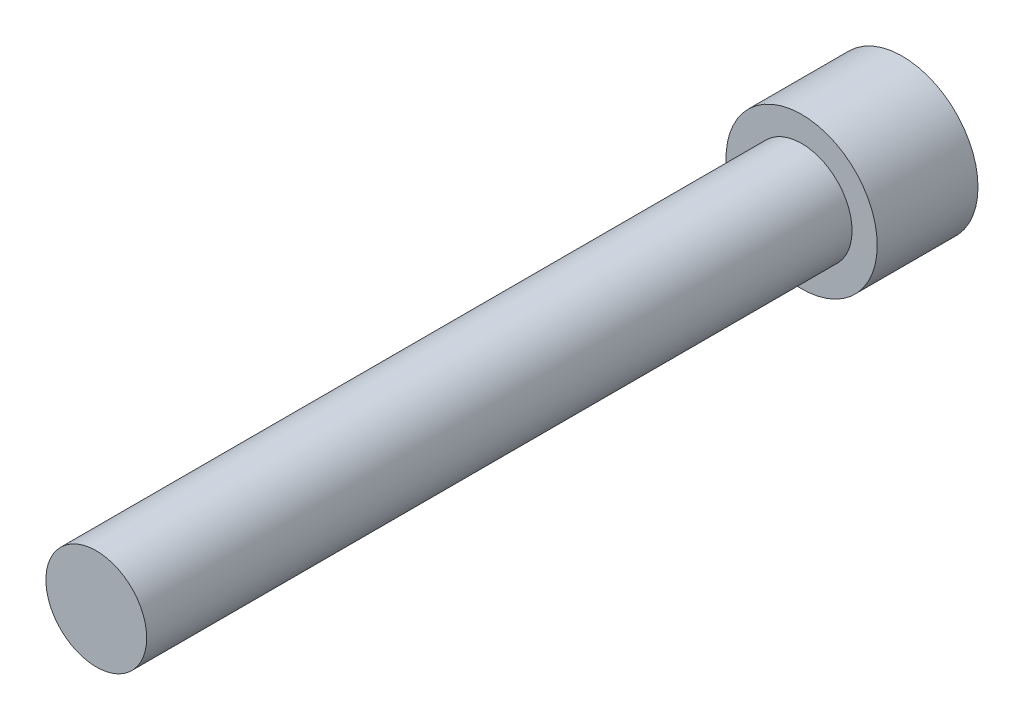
ISO-10303-21;
HEADER;
FILE_DESCRIPTION(('STEP AP214'),'2;1');
FILE_NAME('part.step','',(''),(''),'','','');
FILE_SCHEMA(('AUTOMOTIVE_DESIGN { 1 0 10303 214 1 1 1 1 }'));
ENDSEC;
DATA;
#1=APPLICATION_CONTEXT('core data for automotive mechanical design processes');
#2=APPLICATION_PROTOCOL_DEFINITION('international standard','automotive_design',2000,#1);
#3=PRODUCT_CONTEXT('',#1,'mechanical');
#4=PRODUCT('Part','Part','',(#3));
#5=PRODUCT_RELATED_PRODUCT_CATEGORY('part','',(#4));
#6=PRODUCT_DEFINITION_FORMATION('','',#4);
#7=PRODUCT_DEFINITION_CONTEXT('part definition',#1,'design');
#8=PRODUCT_DEFINITION('design','',#6,#7);
#9=PRODUCT_DEFINITION_SHAPE('','',#8);
#10=(LENGTH_UNIT() NAMED_UNIT(*) SI_UNIT(.MILLI.,.METRE.));
#11=(NAMED_UNIT(*) PLANE_ANGLE_UNIT() SI_UNIT($,.RADIAN.));
#12=(NAMED_UNIT(*) SI_UNIT($,.STERADIAN.) SOLID_ANGLE_UNIT());
#13=UNCERTAINTY_MEASURE_WITH_UNIT(LENGTH_MEASURE(1.E-05),#10,'distance_accuracy_value','');
#14=(GEOMETRIC_REPRESENTATION_CONTEXT(3) GLOBAL_UNCERTAINTY_ASSIGNED_CONTEXT((#13)) GLOBAL_UNIT_ASSIGNED_CONTEXT((#10,
#11,#12)) REPRESENTATION_CONTEXT('',''));
#15=CARTESIAN_POINT('',(0.,0.,0.));
#16=DIRECTION('',(0.,0.,1.));
#17=DIRECTION('',(1.,0.,0.));
#18=AXIS2_PLACEMENT_3D('',#15,#16,#17);
#19=CARTESIAN_POINT('',(0.,-4.7625,-6.35));
#20=DIRECTION('',(0.,0.,-1.));
#21=DIRECTION('',(-1.,0.,0.));
#22=AXIS2_PLACEMENT_3D('',#19,#20,#21);
#23=PLANE('',#22);
#24=DIRECTION('',(0.866025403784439,-0.5,0.));
#25=VECTOR('',#24,1.);
#26=CARTESIAN_POINT('',(0.,2.7569630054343,-6.35));
#27=LINE('',#26,#25);
#28=CARTESIAN_POINT('',(0.,2.7569630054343,-6.35));
#29=VERTEX_POINT('',#28);
#30=CARTESIAN_POINT('',(2.3876,1.37848150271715,-6.35));
#31=VERTEX_POINT('',#30);
#32=EDGE_CURVE('E46',#29,#31,#27,.T.);
#33=ORIENTED_EDGE('',*,*,#32,.F.);
#34=DIRECTION('',(0.866025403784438,0.5,0.));
#35=VECTOR('',#34,1.);
#36=CARTESIAN_POINT('',(-2.3876,1.37848150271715,-6.35));
#37=LINE('',#36,#35);
#38=CARTESIAN_POINT('',(-2.3876,1.37848150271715,-6.35));
#39=VERTEX_POINT('',#38);
#40=EDGE_CURVE('E129',#39,#29,#37,.T.);
#41=ORIENTED_EDGE('',*,*,#40,.F.);
#42=DIRECTION('',(0.,1.,0.));
#43=VECTOR('',#42,1.);
#44=CARTESIAN_POINT('',(-2.3876,-1.37848150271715,-6.35));
#45=LINE('',#44,#43);
#46=CARTESIAN_POINT('',(-2.3876,-1.37848150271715,-6.35));
#47=VERTEX_POINT('',#46);
#48=EDGE_CURVE('E127',#47,#39,#45,.T.);
#49=ORIENTED_EDGE('',*,*,#48,.F.);
#50=DIRECTION('',(-0.866025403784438,0.5,0.));
#51=VECTOR('',#50,1.);
#52=CARTESIAN_POINT('',(0.,-2.7569630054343,-6.35));
#53=LINE('',#52,#51);
#54=CARTESIAN_POINT('',(0.,-2.7569630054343,-6.35));
#55=VERTEX_POINT('',#54);
#56=EDGE_CURVE('E94',#55,#47,#53,.T.);
#57=ORIENTED_EDGE('',*,*,#56,.F.);
#58=DIRECTION('',(-0.866025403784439,-0.5,0.));
#59=VECTOR('',#58,1.);
#60=CARTESIAN_POINT('',(2.3876,-1.37848150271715,-6.35));
#61=LINE('',#60,#59);
#62=CARTESIAN_POINT('',(2.3876,-1.37848150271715,-6.35));
#63=VERTEX_POINT('',#62);
#64=EDGE_CURVE('E123',#63,#55,#61,.T.);
#65=ORIENTED_EDGE('',*,*,#64,.F.);
#66=DIRECTION('',(0.,-1.,0.));
#67=VECTOR('',#66,1.);
#68=CARTESIAN_POINT('',(2.3876,1.37848150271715,-6.35));
#69=LINE('',#68,#67);
#70=EDGE_CURVE('E120',#31,#63,#69,.T.);
#71=ORIENTED_EDGE('',*,*,#70,.F.);
#72=EDGE_LOOP('',(#33,#41,#49,#57,#65,#71));
#73=FACE_BOUND('',#72,.T.);
#74=CARTESIAN_POINT('',(0.,0.,-6.35));
#75=DIRECTION('',(0.,0.,1.));
#76=DIRECTION('',(1.,0.,0.));
#77=AXIS2_PLACEMENT_3D('',#74,#75,#76);
#78=CIRCLE('',#77,4.7625);
#79=CARTESIAN_POINT('',(4.7625,0.,-6.35));
#80=VERTEX_POINT('',#79);
#81=EDGE_CURVE('E11',#80,#80,#78,.T.);
#82=ORIENTED_EDGE('',*,*,#81,.F.);
#83=EDGE_LOOP('',(#82));
#84=FACE_BOUND('',#83,.T.);
#85=ADVANCED_FACE('F32',(#73,#84),#23,.T.);
#86=CARTESIAN_POINT('',(0.,0.,44.45));
#87=DIRECTION('',(0.,0.,1.));
#88=DIRECTION('',(1.,0.,0.));
#89=AXIS2_PLACEMENT_3D('',#86,#87,#88);
#90=CYLINDRICAL_SURFACE('',#89,4.7625);
#91=ORIENTED_EDGE('',*,*,#81,.T.);
#92=EDGE_LOOP('',(#91));
#93=FACE_BOUND('',#92,.T.);
#94=CARTESIAN_POINT('',(0.,0.,0.));
#95=DIRECTION('',(0.,0.,1.));
#96=DIRECTION('',(1.,0.,0.));
#97=AXIS2_PLACEMENT_3D('',#94,#95,#96);
#98=CIRCLE('',#97,4.7625);
#99=CARTESIAN_POINT('',(4.7625,0.,0.));
#100=VERTEX_POINT('',#99);
#101=EDGE_CURVE('E39',#100,#100,#98,.T.);
#102=ORIENTED_EDGE('',*,*,#101,.F.);
#103=EDGE_LOOP('',(#102));
#104=FACE_BOUND('',#103,.T.);
#105=ADVANCED_FACE('F149',(#93,#104),#90,.T.);
#106=CARTESIAN_POINT('',(0.,-3.175,0.));
#107=DIRECTION('',(0.,0.,1.));
#108=DIRECTION('',(1.,0.,0.));
#109=AXIS2_PLACEMENT_3D('',#106,#107,#108);
#110=PLANE('',#109);
#111=ORIENTED_EDGE('',*,*,#101,.T.);
#112=EDGE_LOOP('',(#111));
#113=FACE_BOUND('',#112,.T.);
#114=CARTESIAN_POINT('',(0.,0.,0.));
#115=DIRECTION('',(0.,0.,1.));
#116=DIRECTION('',(1.,0.,0.));
#117=AXIS2_PLACEMENT_3D('',#114,#115,#116);
#118=CIRCLE('',#117,3.175);
#119=CARTESIAN_POINT('',(3.175,0.,0.));
#120=VERTEX_POINT('',#119);
#121=EDGE_CURVE('E141',#120,#120,#118,.T.);
#122=ORIENTED_EDGE('',*,*,#121,.F.);
#123=EDGE_LOOP('',(#122));
#124=FACE_BOUND('',#123,.T.);
#125=ADVANCED_FACE('F146',(#113,#124),#110,.T.);
#126=CARTESIAN_POINT('',(0.,0.,44.45));
#127=DIRECTION('',(0.,0.,1.));
#128=DIRECTION('',(1.,0.,0.));
#129=AXIS2_PLACEMENT_3D('',#126,#127,#128);
#130=CYLINDRICAL_SURFACE('',#129,3.175);
#131=ORIENTED_EDGE('',*,*,#121,.T.);
#132=EDGE_LOOP('',(#131));
#133=FACE_BOUND('',#132,.T.);
#134=CARTESIAN_POINT('',(0.,0.,44.45));
#135=DIRECTION('',(0.,0.,1.));
#136=DIRECTION('',(1.,0.,0.));
#137=AXIS2_PLACEMENT_3D('',#134,#135,#136);
#138=CIRCLE('',#137,3.175);
#139=CARTESIAN_POINT('',(3.175,0.,44.45));
#140=VERTEX_POINT('',#139);
#141=EDGE_CURVE('E133',#140,#140,#138,.T.);
#142=ORIENTED_EDGE('',*,*,#141,.F.);
#143=EDGE_LOOP('',(#142));
#144=FACE_BOUND('',#143,.T.);
#145=ADVANCED_FACE('F156',(#133,#144),#130,.T.);
#146=CARTESIAN_POINT('',(0.,0.,44.45));
#147=DIRECTION('',(0.,0.,1.));
#148=DIRECTION('',(1.,0.,0.));
#149=AXIS2_PLACEMENT_3D('',#146,#147,#148);
#150=PLANE('',#149);
#151=ORIENTED_EDGE('',*,*,#141,.T.);
#152=EDGE_LOOP('',(#151));
#153=FACE_BOUND('',#152,.T.);
#154=ADVANCED_FACE('F162',(#153),#150,.T.);
#155=CARTESIAN_POINT('',(0.,2.7569630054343,-2.794));
#156=DIRECTION('',(0.5,0.866025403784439,0.));
#157=DIRECTION('',(-0.866025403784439,0.5,0.));
#158=AXIS2_PLACEMENT_3D('',#155,#156,#157);
#159=PLANE('',#158);
#160=ORIENTED_EDGE('',*,*,#32,.T.);
#161=DIRECTION('',(0.,0.,-1.));
#162=VECTOR('',#161,1.);
#163=CARTESIAN_POINT('',(2.3876,1.37848150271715,-2.794));
#164=LINE('',#163,#162);
#165=CARTESIAN_POINT('',(2.3876,1.37848150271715,-2.794));
#166=VERTEX_POINT('',#165);
#167=EDGE_CURVE('E76',#166,#31,#164,.T.);
#168=ORIENTED_EDGE('',*,*,#167,.F.);
#169=DIRECTION('',(0.866025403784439,-0.5,0.));
#170=VECTOR('',#169,1.);
#171=CARTESIAN_POINT('',(0.,2.7569630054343,-2.794));
#172=LINE('',#171,#170);
#173=CARTESIAN_POINT('',(0.,2.7569630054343,-2.794));
#174=VERTEX_POINT('',#173);
#175=EDGE_CURVE('E131',#174,#166,#172,.T.);
#176=ORIENTED_EDGE('',*,*,#175,.F.);
#177=DIRECTION('',(0.,0.,-1.));
#178=VECTOR('',#177,1.);
#179=CARTESIAN_POINT('',(0.,2.7569630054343,-2.794));
#180=LINE('',#179,#178);
#181=EDGE_CURVE('E54',#174,#29,#180,.T.);
#182=ORIENTED_EDGE('',*,*,#181,.T.);
#183=EDGE_LOOP('',(#160,#168,#176,#182));
#184=FACE_BOUND('',#183,.T.);
#185=ADVANCED_FACE('F166',(#184),#159,.F.);
#186=CARTESIAN_POINT('',(-2.3876,1.37848150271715,-2.794));
#187=DIRECTION('',(-0.5,0.866025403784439,0.));
#188=DIRECTION('',(-0.866025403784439,-0.5,0.));
#189=AXIS2_PLACEMENT_3D('',#186,#187,#188);
#190=PLANE('',#189);
#191=ORIENTED_EDGE('',*,*,#40,.T.);
#192=ORIENTED_EDGE('',*,*,#181,.F.);
#193=DIRECTION('',(0.866025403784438,0.5,0.));
#194=VECTOR('',#193,1.);
#195=CARTESIAN_POINT('',(-2.3876,1.37848150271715,-2.794));
#196=LINE('',#195,#194);
#197=CARTESIAN_POINT('',(-2.3876,1.37848150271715,-2.794));
#198=VERTEX_POINT('',#197);
#199=EDGE_CURVE('E106',#198,#174,#196,.T.);
#200=ORIENTED_EDGE('',*,*,#199,.F.);
#201=DIRECTION('',(0.,0.,-1.));
#202=VECTOR('',#201,1.);
#203=CARTESIAN_POINT('',(-2.3876,1.37848150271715,-2.794));
#204=LINE('',#203,#202);
#205=EDGE_CURVE('E98',#198,#39,#204,.T.);
#206=ORIENTED_EDGE('',*,*,#205,.T.);
#207=EDGE_LOOP('',(#191,#192,#200,#206));
#208=FACE_BOUND('',#207,.T.);
#209=ADVANCED_FACE('F170',(#208),#190,.F.);
#210=CARTESIAN_POINT('',(-2.3876,-1.37848150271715,-2.794));
#211=DIRECTION('',(-1.,0.,0.));
#212=DIRECTION('',(0.,0.,1.));
#213=AXIS2_PLACEMENT_3D('',#210,#211,#212);
#214=PLANE('',#213);
#215=ORIENTED_EDGE('',*,*,#48,.T.);
#216=ORIENTED_EDGE('',*,*,#205,.F.);
#217=DIRECTION('',(0.,1.,0.));
#218=VECTOR('',#217,1.);
#219=CARTESIAN_POINT('',(-2.3876,-1.37848150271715,-2.794));
#220=LINE('',#219,#218);
#221=CARTESIAN_POINT('',(-2.3876,-1.37848150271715,-2.794));
#222=VERTEX_POINT('',#221);
#223=EDGE_CURVE('E102',#222,#198,#220,.T.);
#224=ORIENTED_EDGE('',*,*,#223,.F.);
#225=DIRECTION('',(0.,0.,-1.));
#226=VECTOR('',#225,1.);
#227=CARTESIAN_POINT('',(-2.3876,-1.37848150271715,-2.794));
#228=LINE('',#227,#226);
#229=EDGE_CURVE('E87',#222,#47,#228,.T.);
#230=ORIENTED_EDGE('',*,*,#229,.T.);
#231=EDGE_LOOP('',(#215,#216,#224,#230));
#232=FACE_BOUND('',#231,.T.);
#233=ADVANCED_FACE('F103',(#232),#214,.F.);
#234=CARTESIAN_POINT('',(0.,-2.7569630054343,-2.794));
#235=DIRECTION('',(-0.5,-0.866025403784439,0.));
#236=DIRECTION('',(0.866025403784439,-0.5,0.));
#237=AXIS2_PLACEMENT_3D('',#234,#235,#236);
#238=PLANE('',#237);
#239=ORIENTED_EDGE('',*,*,#56,.T.);
#240=ORIENTED_EDGE('',*,*,#229,.F.);
#241=DIRECTION('',(-0.866025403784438,0.5,0.));
#242=VECTOR('',#241,1.);
#243=CARTESIAN_POINT('',(0.,-2.7569630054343,-2.794));
#244=LINE('',#243,#242);
#245=CARTESIAN_POINT('',(0.,-2.7569630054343,-2.794));
#246=VERTEX_POINT('',#245);
#247=EDGE_CURVE('E91',#246,#222,#244,.T.);
#248=ORIENTED_EDGE('',*,*,#247,.F.);
#249=DIRECTION('',(0.,0.,-1.));
#250=VECTOR('',#249,1.);
#251=CARTESIAN_POINT('',(0.,-2.7569630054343,-2.794));
#252=LINE('',#251,#250);
#253=EDGE_CURVE('E99',#246,#55,#252,.T.);
#254=ORIENTED_EDGE('',*,*,#253,.T.);
#255=EDGE_LOOP('',(#239,#240,#248,#254));
#256=FACE_BOUND('',#255,.T.);
#257=ADVANCED_FACE('F89',(#256),#238,.F.);
#258=CARTESIAN_POINT('',(2.3876,-1.37848150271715,-2.794));
#259=DIRECTION('',(0.5,-0.866025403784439,0.));
#260=DIRECTION('',(0.866025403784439,0.5,0.));
#261=AXIS2_PLACEMENT_3D('',#258,#259,#260);
#262=PLANE('',#261);
#263=ORIENTED_EDGE('',*,*,#64,.T.);
#264=ORIENTED_EDGE('',*,*,#253,.F.);
#265=DIRECTION('',(-0.866025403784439,-0.5,0.));
#266=VECTOR('',#265,1.);
#267=CARTESIAN_POINT('',(2.3876,-1.37848150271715,-2.794));
#268=LINE('',#267,#266);
#269=CARTESIAN_POINT('',(2.3876,-1.37848150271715,-2.794));
#270=VERTEX_POINT('',#269);
#271=EDGE_CURVE('E112',#270,#246,#268,.T.);
#272=ORIENTED_EDGE('',*,*,#271,.F.);
#273=DIRECTION('',(0.,0.,-1.));
#274=VECTOR('',#273,1.);
#275=CARTESIAN_POINT('',(2.3876,-1.37848150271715,-2.794));
#276=LINE('',#275,#274);
#277=EDGE_CURVE('E136',#270,#63,#276,.T.);
#278=ORIENTED_EDGE('',*,*,#277,.T.);
#279=EDGE_LOOP('',(#263,#264,#272,#278));
#280=FACE_BOUND('',#279,.T.);
#281=ADVANCED_FACE('F174',(#280),#262,.F.);
#282=CARTESIAN_POINT('',(2.3876,1.37848150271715,-2.794));
#283=DIRECTION('',(1.,0.,0.));
#284=DIRECTION('',(0.,0.,-1.));
#285=AXIS2_PLACEMENT_3D('',#282,#283,#284);
#286=PLANE('',#285);
#287=ORIENTED_EDGE('',*,*,#70,.T.);
#288=ORIENTED_EDGE('',*,*,#277,.F.);
#289=DIRECTION('',(0.,-1.,0.));
#290=VECTOR('',#289,1.);
#291=CARTESIAN_POINT('',(2.3876,1.37848150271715,-2.794));
#292=LINE('',#291,#290);
#293=EDGE_CURVE('E114',#166,#270,#292,.T.);
#294=ORIENTED_EDGE('',*,*,#293,.F.);
#295=ORIENTED_EDGE('',*,*,#167,.T.);
#296=EDGE_LOOP('',(#287,#288,#294,#295));
#297=FACE_BOUND('',#296,.T.);
#298=ADVANCED_FACE('F171',(#297),#286,.F.);
#299=CARTESIAN_POINT('',(0.,2.7569630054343,-2.794));
#300=DIRECTION('',(0.,0.,1.));
#301=DIRECTION('',(1.,0.,0.));
#302=AXIS2_PLACEMENT_3D('',#299,#300,#301);
#303=PLANE('',#302);
#304=ORIENTED_EDGE('',*,*,#175,.T.);
#305=ORIENTED_EDGE('',*,*,#293,.T.);
#306=ORIENTED_EDGE('',*,*,#271,.T.);
#307=ORIENTED_EDGE('',*,*,#247,.T.);
#308=ORIENTED_EDGE('',*,*,#223,.T.);
#309=ORIENTED_EDGE('',*,*,#199,.T.);
#310=EDGE_LOOP('',(#304,#305,#306,#307,#308,#309));
#311=FACE_BOUND('',#310,.T.);
#312=ADVANCED_FACE('F109',(#311),#303,.F.);
#313=CLOSED_SHELL('',(#85,#105,#125,#145,#154,#185,#209,#233,#257,#281,#298,#312));
#314=MANIFOLD_SOLID_BREP('B2',#313);
#315=ADVANCED_BREP_SHAPE_REPRESENTATION('',(#18,#314),#14);
#316=SHAPE_DEFINITION_REPRESENTATION(#9,#315);
ENDSEC;
END-ISO-10303-21;
